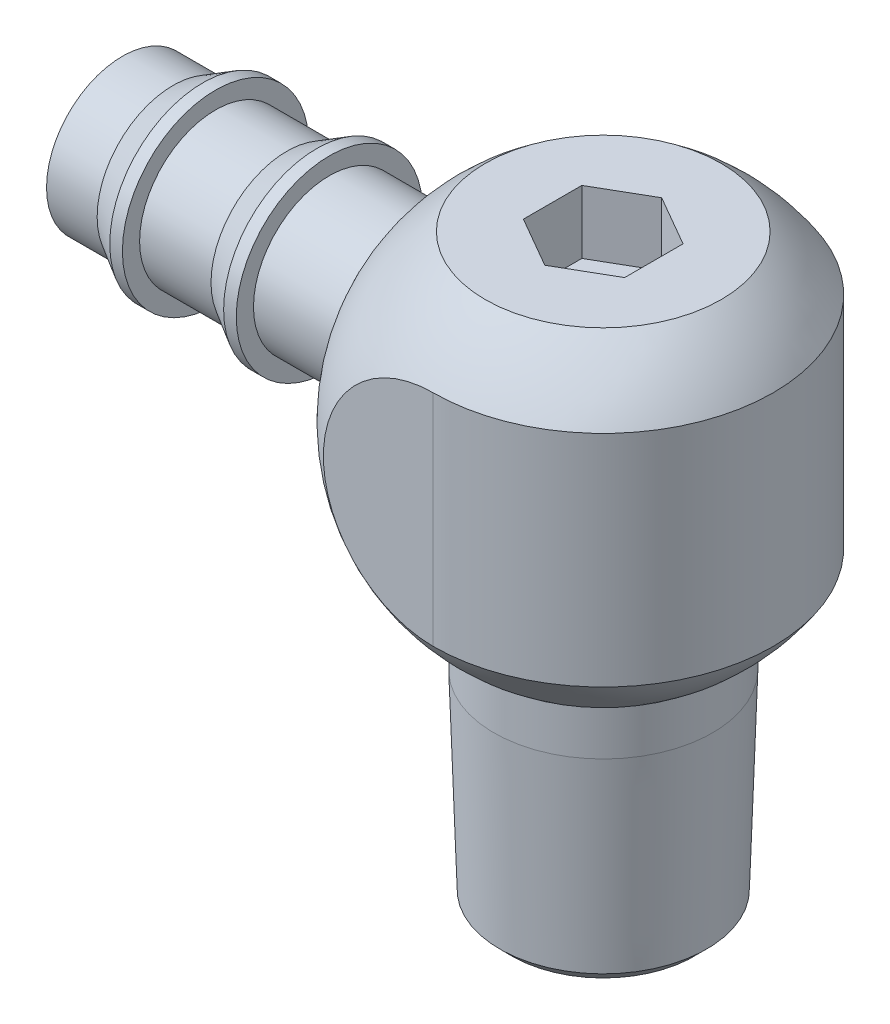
from build123d import *

# Parameters (mm, degrees)
CUT_EXTRUDE1_DEPTH      = 34.842157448
CUT_EXTRUDE1_DEPTH_BACK = 34.842157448
SKETCH3_OUTSIDE_W       = 36.198
SKETCH3_OUTSIDE_H       = 36.198
CUT_EXTRUDE2_DEPTH      = 33.408703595
CUT_EXTRUDE2_DEPTH_BACK = 33.408703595
SKETCH4_OUTSIDE_W       = 31.224
SKETCH4_OUTSIDE_H       = 35.288
SKETCH4_OUTSIDE_W_2     = 38.1
SKETCH4_OUTSIDE_H_2     = 20.6375
FILLET1_R               = 1.190625
CUT_EXTRUDE3_START      = -30.1625
SKETCH10_R              = 3.4925
CUT_EXTRUDE3_DEPTH      = 30.1625
CUT_EXTRUDE4_DEPTH      = 3.96875
SKETCH13_R              = 4.7625
CUT_EXTRUDE5_DEPTH      = 29.68752


with BuildPart() as part:
    # Sketch1 → Revolve1 (revolve)
    with BuildSketch(Plane.XY):
        with BuildLine():
            Line((0, 28.68295), (0, 3.28295))
            ThreePointArc((0, 3.28295), (12.7, 15.98295), (0, 28.68295))
        make_face()
    revolve(axis=Axis((0, 0, 0), (0, 1, 0)))

    # Sketch3 outside → Cut-Extrude1 (cut, two sides: drawn at the far end of the back side and taken through both)
    with BuildSketch(Plane(origin=(0, 0, 0), x_dir=(1, 0, 0), z_dir=(0, 1, 0)).offset(-CUT_EXTRUDE1_DEPTH_BACK)):
        Rectangle(SKETCH3_OUTSIDE_W, SKETCH3_OUTSIDE_H)
        with BuildLine():
            Line((0, -10.668), (-10.668, -10.668))
            Line((-10.668, -10.668), (-10.668, 10.668))
            Line((-10.668, 10.668), (0, 10.668))
            ThreePointArc((0, 10.668), (10.668, 0), (0, -10.668))
        make_face(mode=Mode.SUBTRACT)
    extrude(amount=CUT_EXTRUDE1_DEPTH + CUT_EXTRUDE1_DEPTH_BACK, mode=Mode.SUBTRACT)

    # Sketch4 outside → Cut-Extrude2 (cut, two sides: drawn at the far end of the back side and taken through both)
    with BuildSketch(Plane.XY.offset(-CUT_EXTRUDE2_DEPTH_BACK)):
        with Locations((0, 15.983)):
            Rectangle(SKETCH4_OUTSIDE_W, SKETCH4_OUTSIDE_H)
        with Locations((0, 15.98295)):
            Rectangle(SKETCH4_OUTSIDE_W_2, SKETCH4_OUTSIDE_H_2, mode=Mode.SUBTRACT)
    extrude(amount=CUT_EXTRUDE2_DEPTH + CUT_EXTRUDE2_DEPTH_BACK, mode=Mode.SUBTRACT)

    # Sketch9 → Revolve2 (revolve)
    with BuildSketch(Plane(origin=(0, 15.98295, 0), x_dir=(1, 0, 0), z_dir=(0, 1, 0)), mode=Mode.PRIVATE) as revolve2_sk:
        Polygon((-30.1625, 0), (-30.1625, 4.7625), (-26.9875, 4.7625), (-25.117751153, 5.842), (-24.324001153, 5.842), (-24.324001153, 4.7625), (-19.84375, 4.7625), (-17.974001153, 5.842), (-17.180251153, 5.842), (-17.180251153, 4.7625), (0, 4.7625), (0, 0), align=None)
    revolve(revolve2_sk.sketch.rotate(Axis((0, 15.98295, 0), (1, 0, 0)), 180), axis=Axis((0, 15.98295, 0), (1, 0, 0)))

    # Fillet1
    fillet1_edges = [part.edges().sort_by_distance(p)[0] for p in [
        (-10.668, 15.98295, -4.7625),
    ]]
    fillet(fillet1_edges, radius=FILLET1_R)

    # Sketch10 → Cut-Extrude3 (cut)
    with BuildSketch(Plane.ZY.offset(30.1625).offset(CUT_EXTRUDE3_START)):
        with Locations((0, 15.98295)):
            Circle(SKETCH10_R)
    extrude(amount=CUT_EXTRUDE3_DEPTH, mode=Mode.SUBTRACT)

    # Sketch11 → Revolve3 (revolve)
    with BuildSketch(Plane.XY, mode=Mode.PRIVATE) as revolve3_sk:
        Polygon((6.484939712, -9.4488), (6.858, 2.4892), (6.858, 5.6642), (0, 5.6642), (0, -10.2108), (5.722939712, -10.2108), align=None)
    revolve(revolve3_sk.sketch.rotate(Axis((0, -11.019594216, 0), (0, -1, 0)), 180), axis=Axis((0, -11.019594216, 0), (0, -1, 0)))

    # Sketch12 → Cut-Extrude4 (cut)
    with BuildSketch(Plane(origin=(0, 26.3017, 0), x_dir=(1, 0, 0), z_dir=(0, 1, 0))):
        Polygon((3.175, 1.833087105), (0, 3.666174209), (-3.175, 1.833087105), (-3.175, -1.833087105), (0, -3.666174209), (3.175, -1.833087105), align=None)
    extrude(amount=-CUT_EXTRUDE4_DEPTH, mode=Mode.SUBTRACT)

    # Sketch13 → Cut-Extrude5 (cut)
    with BuildSketch(Plane.XZ.offset(10.2108)):
        Circle(SKETCH13_R)
    extrude(amount=-CUT_EXTRUDE5_DEPTH, mode=Mode.SUBTRACT)


solid = part.part
